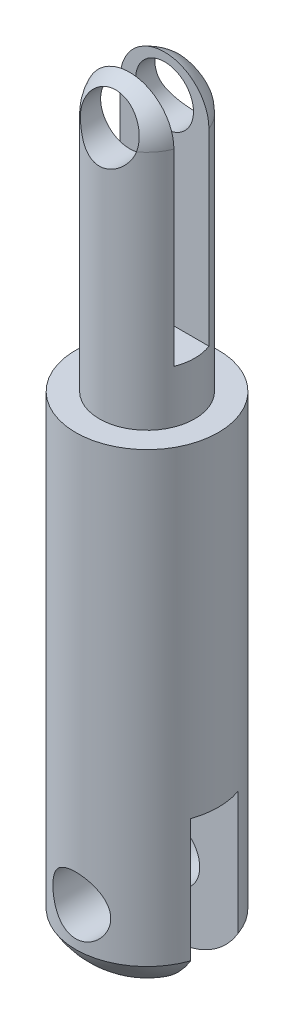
from build123d import *

# Parameters (mm, degrees)
ENL_V_MAT_EXTRU_1_DEPTH      = 34.284906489
ENL_V_MAT_EXTRU_1_DEPTH_BACK = 34.284906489
ESQUISSE4_R                  = 1.925
ENL_V_MAT_EXTRU_2_DEPTH      = 34.284906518
ENL_V_MAT_EXTRU_2_DEPTH_BACK = 34.284906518
ESQUISSE5_W                  = 2.33
ESQUISSE5_H                  = 20.525
ESQUISSE5_W_2                = 3.16
ESQUISSE5_H_2                = 15.570982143


with BuildPart() as part:
    # Esquisse3 → R_volution1 (revolve)
    with BuildSketch(Plane.XY):
        with BuildLine():
            Line((3.175, 0), (4.75, 0))
            Line((4.75, 0), (4.75, -29.8))
            ThreePointArc((4.75, -29.8), (2.756923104, -31.847905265), (0, -32.6))
            Line((0, -32.6), (0, 19.2))
            ThreePointArc((0, 19.2), (2.24506403, 18.27006403), (3.175, 16.025))
            Line((3.175, 16.025), (3.175, 0))
        make_face()
    revolve(axis=Axis((0, -32.6, 0), (0, 1, 0)))

    # Esquisse4 → Enl_v. mat.-Extru.1 (cut, two sides: drawn at the far end of the back side and taken through both)
    with BuildSketch(Plane.XY.offset(-ENL_V_MAT_EXTRU_1_DEPTH_BACK)):
        with Locations(Location((0, 16.495, 0), (0, 0, 345.868047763))):
            Circle(ESQUISSE4_R)
        with Locations((0, -27.255)):
            Circle(ESQUISSE4_R)
    extrude(amount=ENL_V_MAT_EXTRU_1_DEPTH + ENL_V_MAT_EXTRU_1_DEPTH_BACK, mode=Mode.SUBTRACT)

    # Esquisse5 → Enl_v. mat.-Extru.2 (cut, two sides: drawn at the far end of the back side and taken through both)
    with BuildSketch(Plane(origin=(0, 0, 0), x_dir=(0, 0, -1), z_dir=(1, 0, 0)).offset(-ENL_V_MAT_EXTRU_2_DEPTH_BACK)):
        with Locations((0, 13.7625)):
            Rectangle(ESQUISSE5_W, ESQUISSE5_H)
        with Locations((0, -29.385491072)):
            Rectangle(ESQUISSE5_W_2, ESQUISSE5_H_2)
    extrude(amount=ENL_V_MAT_EXTRU_2_DEPTH + ENL_V_MAT_EXTRU_2_DEPTH_BACK, mode=Mode.SUBTRACT)


solid = part.part
